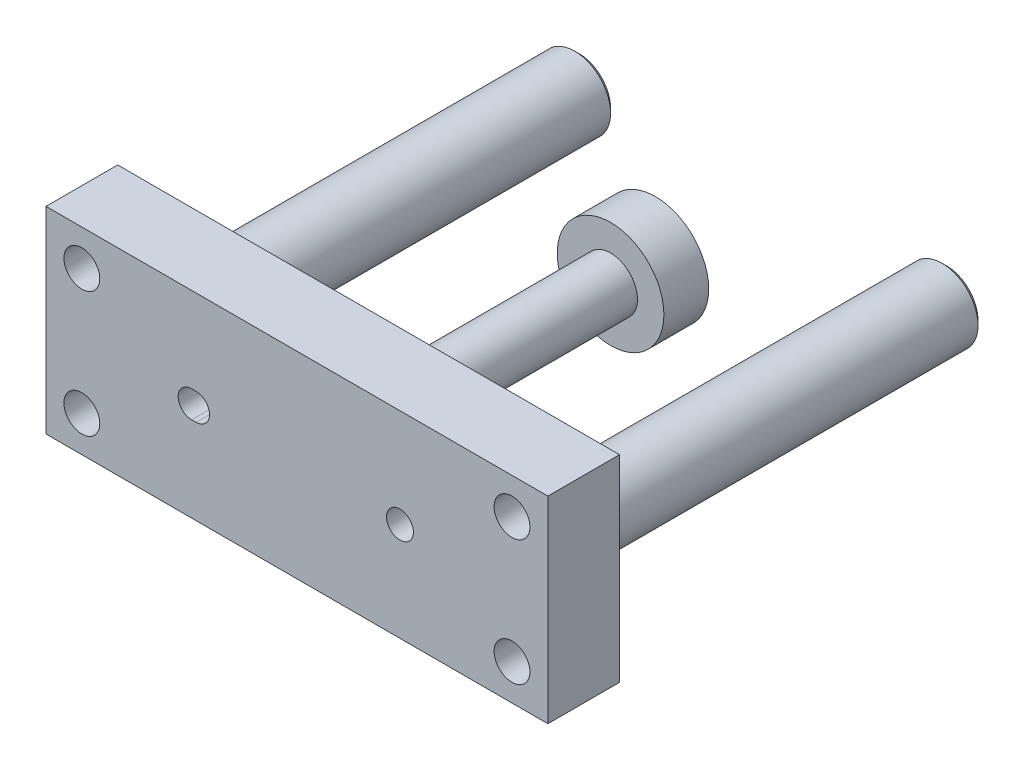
from build123d import *

# Parameters (mm, degrees)
SKETCH1_R                  = 5.95
PISTON_DEPTH               = 2.5
SKETCH2_R                  = 3
ROD_DEPTH                  = 29.5
SKETCH3_W                  = 56
SKETCH3_H                  = 22
PLATE_DEPTH                = 8
SKETCH4_R                  = 4
GUIDES_DEPTH               = 44
SKETCH5_R                  = 1.5
POSITION_HOLES_DEPTH       = 6
OBLONG_POSITION_HOLE_DEPTH = 3
CHAMFER1_SIZE              = 0.5
SKETCH6_R                  = 2
MOUNTHOLES2_DEPTH          = 61.074953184


with BuildPart() as part:
    # Sketch1 → Piston (new, symmetric)
    with BuildSketch(Plane.XY):
        Circle(SKETCH1_R)
    extrude(amount=PISTON_DEPTH, both=True)

    # Sketch2 → Rod (add)
    with BuildSketch(Plane.XY):
        Circle(SKETCH2_R)
    extrude(amount=ROD_DEPTH)

    # Sketch3 → Plate (add)
    with BuildSketch(Plane.XY.offset(29.5)):
        Rectangle(SKETCH3_W, SKETCH3_H)
    extrude(amount=PLATE_DEPTH)

    # Sketch4 → Guides (add)
    with BuildSketch(Plane(origin=(0, 0, 29.5), x_dir=(-1, 0, 0), z_dir=(0, 0, -1))):
        with Locations(Location((-20.5, 0, 0), (0, 0, 180))):
            Circle(SKETCH4_R)
        with Locations(Location((20.5, 0, 0), (0, 0, 180))):
            Circle(SKETCH4_R)
    extrude(amount=GUIDES_DEPTH)

    # Sketch5 → Position Holes (cut)
    with BuildSketch(Plane.XY.offset(37.5)):
        with Locations((11.5, 0)):
            Circle(SKETCH5_R)
        with Locations(Location((-11.5, 0, 0), (0, 0, 180))):
            Circle(SKETCH5_R)
    extrude(amount=-POSITION_HOLES_DEPTH, mode=Mode.SUBTRACT)

    # Sketch8 → Oblong Position Hole (cut)
    with BuildSketch(Plane.XY.offset(37.5)):
        with BuildLine():
            Line((-11.75, 1.5), (-11.25, 1.5))
            ThreePointArc((-11.25, 1.5), (-9.75, 0), (-11.25, -1.5))
            Line((-11.25, -1.5), (-11.75, -1.5))
            ThreePointArc((-11.75, -1.5), (-13.25, 0), (-11.75, 1.5))
        make_face()
    extrude(amount=-OBLONG_POSITION_HOLE_DEPTH, mode=Mode.SUBTRACT)

    # Chamfer1
    chamfer1_edges = [part.edges().sort_by_distance(p)[0] for p in [
        (16.5, 0, -14.5),
        (-24.5, 0, -14.5),
    ]]
    chamfer(chamfer1_edges, length=CHAMFER1_SIZE)

    # Sketch6 → MountHoles2 (cut, through all)
    with BuildSketch(Plane.XY.offset(37.5)):
        with Locations((24, 7)):
            Circle(SKETCH6_R)
        with Locations((-24, 7)):
            Circle(SKETCH6_R)
        with Locations((24, -7)):
            Circle(SKETCH6_R)
        with Locations((-24, -7)):
            Circle(SKETCH6_R)
    extrude(amount=-MOUNTHOLES2_DEPTH, mode=Mode.SUBTRACT)


solid = part.part
